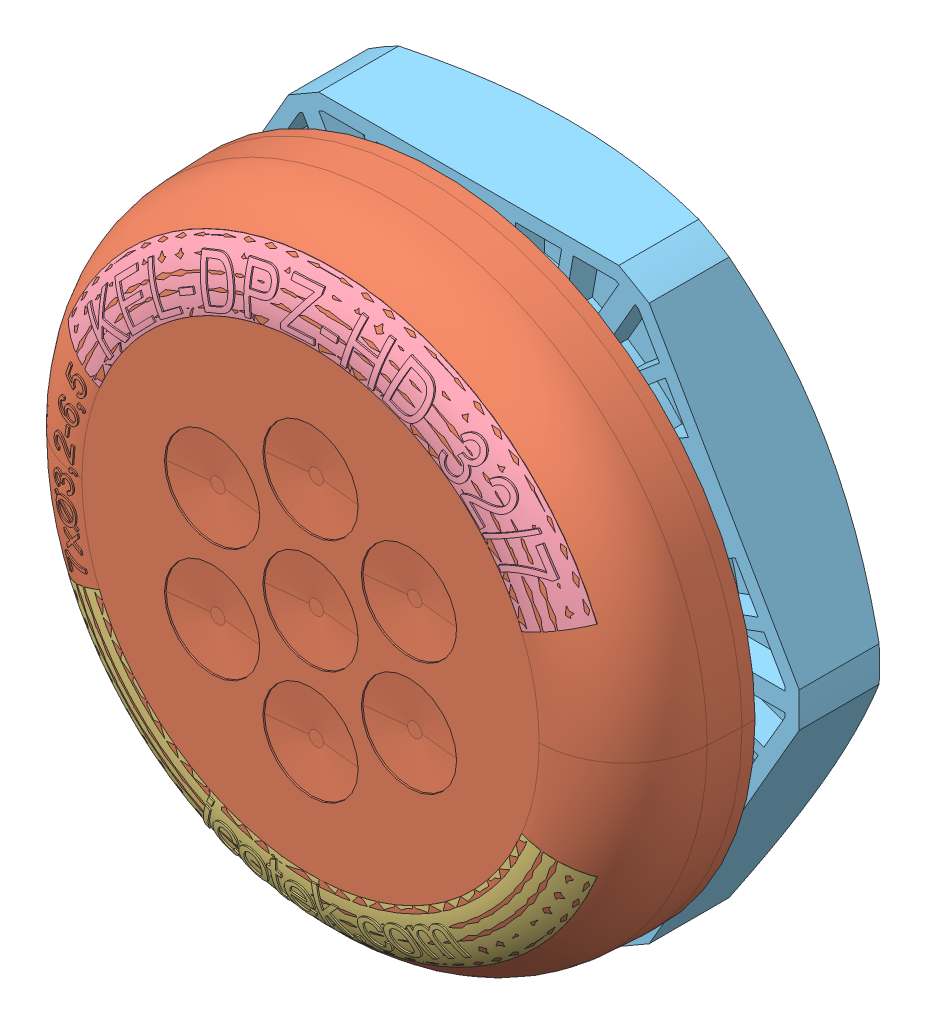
SolidWorks assembly 70353.SLDASM, configuration Default (file format 8000). Lengths in mm.
Overall size (46 46.01 22.11).
5 component instances, 5 part files, 0 mates.
Components (placement in the parent):
- 70353_01-1: 70353_01.SLDPRT [Default] at origin size (42 42 19)
- 70353_02-1: 70353_02.SLDPRT [Default] at origin size (44 44 10.11)
- 70353_03-1: 70353_03.SLDPRT [Default] at origin size (36.74 13.81 3.1)
- 70353_04-1: 70353_04.SLDPRT [Default] at origin size (36.74 13.81 3.11)
- 70353_05-1: 70353_05.SLDPRT [Default] at origin size (46 46.01 7)
